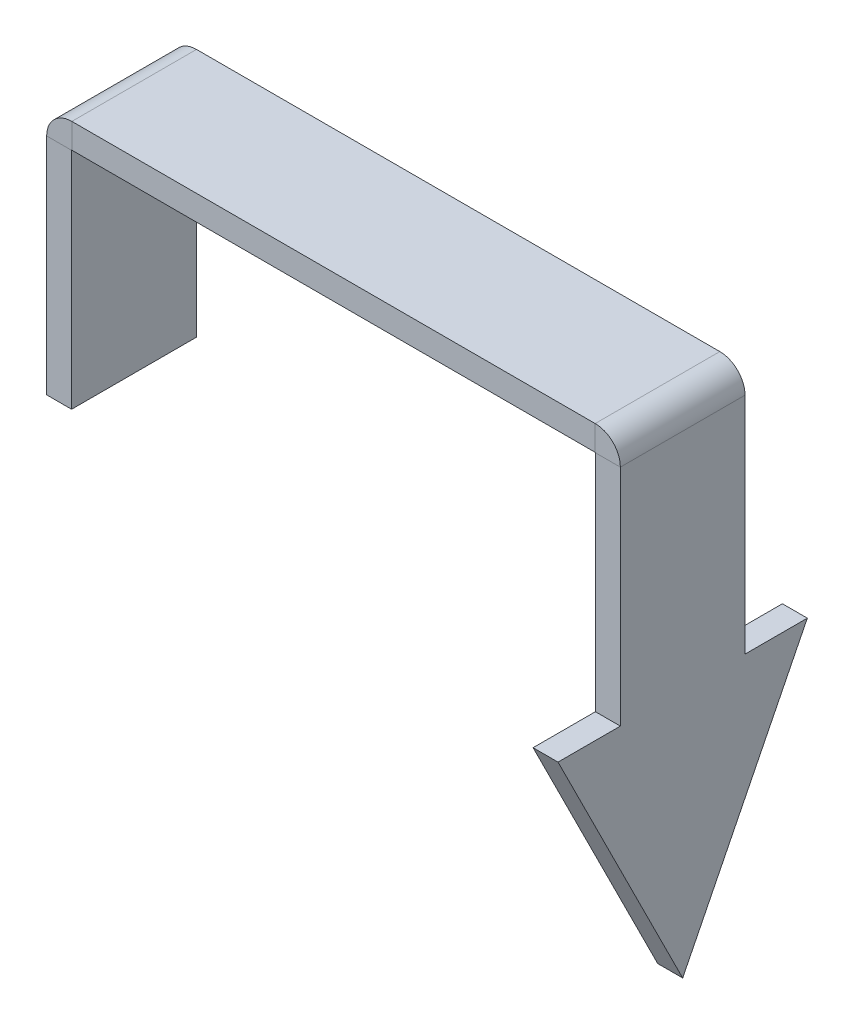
ISO-10303-21;
HEADER;
FILE_DESCRIPTION(('STEP AP214'),'2;1');
FILE_NAME('part.step','',(''),(''),'','','');
FILE_SCHEMA(('AUTOMOTIVE_DESIGN { 1 0 10303 214 1 1 1 1 }'));
ENDSEC;
DATA;
#1=APPLICATION_CONTEXT('core data for automotive mechanical design processes');
#2=APPLICATION_PROTOCOL_DEFINITION('international standard','automotive_design',2000,#1);
#3=PRODUCT_CONTEXT('',#1,'mechanical');
#4=PRODUCT('Part','Part','',(#3));
#5=PRODUCT_RELATED_PRODUCT_CATEGORY('part','',(#4));
#6=PRODUCT_DEFINITION_FORMATION('','',#4);
#7=PRODUCT_DEFINITION_CONTEXT('part definition',#1,'design');
#8=PRODUCT_DEFINITION('design','',#6,#7);
#9=PRODUCT_DEFINITION_SHAPE('','',#8);
#10=(LENGTH_UNIT() NAMED_UNIT(*) SI_UNIT(.MILLI.,.METRE.));
#11=(NAMED_UNIT(*) PLANE_ANGLE_UNIT() SI_UNIT($,.RADIAN.));
#12=(NAMED_UNIT(*) SI_UNIT($,.STERADIAN.) SOLID_ANGLE_UNIT());
#13=UNCERTAINTY_MEASURE_WITH_UNIT(LENGTH_MEASURE(1.E-05),#10,'distance_accuracy_value','');
#14=(GEOMETRIC_REPRESENTATION_CONTEXT(3) GLOBAL_UNCERTAINTY_ASSIGNED_CONTEXT((#13)) GLOBAL_UNIT_ASSIGNED_CONTEXT((#10,
#11,#12)) REPRESENTATION_CONTEXT('',''));
#15=CARTESIAN_POINT('',(0.,0.,0.));
#16=DIRECTION('',(0.,0.,1.));
#17=DIRECTION('',(1.,0.,0.));
#18=AXIS2_PLACEMENT_3D('',#15,#16,#17);
#19=CARTESIAN_POINT('',(33.,0.,-2.5));
#20=DIRECTION('',(0.,1.,0.));
#21=DIRECTION('',(0.,0.,1.));
#22=AXIS2_PLACEMENT_3D('',#19,#20,#21);
#23=PLANE('',#22);
#24=DIRECTION('',(-1.,0.,0.));
#25=VECTOR('',#24,1.);
#26=CARTESIAN_POINT('',(-10.,0.,-2.5));
#27=LINE('',#26,#25);
#28=CARTESIAN_POINT('',(21.995,0.,-2.5));
#29=VERTEX_POINT('',#28);
#30=CARTESIAN_POINT('',(1.00500000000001,0.,-2.5));
#31=VERTEX_POINT('',#30);
#32=EDGE_CURVE('E266',#29,#31,#27,.T.);
#33=ORIENTED_EDGE('',*,*,#32,.F.);
#34=DIRECTION('',(0.,0.,1.));
#35=VECTOR('',#34,1.);
#36=CARTESIAN_POINT('',(21.995,0.,-2.5));
#37=LINE('',#36,#35);
#38=CARTESIAN_POINT('',(21.995,1.53963469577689E-08,2.5));
#39=VERTEX_POINT('',#38);
#40=EDGE_CURVE('E49',#29,#39,#37,.T.);
#41=ORIENTED_EDGE('',*,*,#40,.T.);
#42=DIRECTION('',(1.,0.,0.));
#43=VECTOR('',#42,1.);
#44=CARTESIAN_POINT('',(-10.,0.,2.5));
#45=LINE('',#44,#43);
#46=CARTESIAN_POINT('',(1.00500000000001,0.,2.5));
#47=VERTEX_POINT('',#46);
#48=EDGE_CURVE('E65',#47,#39,#45,.T.);
#49=ORIENTED_EDGE('',*,*,#48,.F.);
#50=DIRECTION('',(0.,0.,1.));
#51=VECTOR('',#50,1.);
#52=CARTESIAN_POINT('',(1.00500000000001,0.,-2.5));
#53=LINE('',#52,#51);
#54=EDGE_CURVE('E274',#31,#47,#53,.T.);
#55=ORIENTED_EDGE('',*,*,#54,.F.);
#56=EDGE_LOOP('',(#33,#41,#49,#55));
#57=FACE_BOUND('',#56,.T.);
#58=ADVANCED_FACE('F40',(#57),#23,.F.);
#59=CARTESIAN_POINT('',(-10.,1.,2.5));
#60=DIRECTION('',(0.,0.,-1.));
#61=DIRECTION('',(-1.,0.,0.));
#62=AXIS2_PLACEMENT_3D('',#59,#60,#61);
#63=PLANE('',#62);
#64=ORIENTED_EDGE('',*,*,#48,.T.);
#65=DIRECTION('',(0.,1.,0.));
#66=VECTOR('',#65,1.);
#67=CARTESIAN_POINT('',(21.995,1.,2.5));
#68=LINE('',#67,#66);
#69=CARTESIAN_POINT('',(21.995,1.00000001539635,2.5));
#70=VERTEX_POINT('',#69);
#71=EDGE_CURVE('E282',#39,#70,#68,.T.);
#72=ORIENTED_EDGE('',*,*,#71,.T.);
#73=DIRECTION('',(1.,0.,0.));
#74=VECTOR('',#73,1.);
#75=CARTESIAN_POINT('',(-10.,1.,2.5));
#76=LINE('',#75,#74);
#77=CARTESIAN_POINT('',(1.005,0.999999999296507,2.5));
#78=VERTEX_POINT('',#77);
#79=EDGE_CURVE('E271',#78,#70,#76,.T.);
#80=ORIENTED_EDGE('',*,*,#79,.F.);
#81=DIRECTION('',(0.,1.,0.));
#82=VECTOR('',#81,1.);
#83=CARTESIAN_POINT('',(1.005,1.,2.5));
#84=LINE('',#83,#82);
#85=EDGE_CURVE('E277',#47,#78,#84,.T.);
#86=ORIENTED_EDGE('',*,*,#85,.F.);
#87=EDGE_LOOP('',(#64,#72,#80,#86));
#88=FACE_BOUND('',#87,.T.);
#89=ADVANCED_FACE('F338',(#88),#63,.F.);
#90=CARTESIAN_POINT('',(-10.,1.,-2.5));
#91=DIRECTION('',(0.,0.,1.));
#92=DIRECTION('',(1.,0.,0.));
#93=AXIS2_PLACEMENT_3D('',#90,#91,#92);
#94=PLANE('',#93);
#95=DIRECTION('',(-1.,0.,0.));
#96=VECTOR('',#95,1.);
#97=CARTESIAN_POINT('',(-10.,1.,-2.5));
#98=LINE('',#97,#96);
#99=CARTESIAN_POINT('',(21.995,1.00000000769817,-2.5));
#100=VERTEX_POINT('',#99);
#101=CARTESIAN_POINT('',(1.005,1.,-2.5));
#102=VERTEX_POINT('',#101);
#103=EDGE_CURVE('E44',#100,#102,#98,.T.);
#104=ORIENTED_EDGE('',*,*,#103,.F.);
#105=DIRECTION('',(0.,-1.,0.));
#106=VECTOR('',#105,1.);
#107=CARTESIAN_POINT('',(21.995,1.,-2.5));
#108=LINE('',#107,#106);
#109=EDGE_CURVE('E12',#100,#29,#108,.T.);
#110=ORIENTED_EDGE('',*,*,#109,.T.);
#111=ORIENTED_EDGE('',*,*,#32,.T.);
#112=DIRECTION('',(0.,-1.,0.));
#113=VECTOR('',#112,1.);
#114=CARTESIAN_POINT('',(1.005,1.,-2.5));
#115=LINE('',#114,#113);
#116=EDGE_CURVE('E270',#102,#31,#115,.T.);
#117=ORIENTED_EDGE('',*,*,#116,.F.);
#118=EDGE_LOOP('',(#104,#110,#111,#117));
#119=FACE_BOUND('',#118,.T.);
#120=ADVANCED_FACE('F42',(#119),#94,.F.);
#121=CARTESIAN_POINT('',(33.,1.,-2.5));
#122=DIRECTION('',(0.,1.,0.));
#123=DIRECTION('',(0.,0.,1.));
#124=AXIS2_PLACEMENT_3D('',#121,#122,#123);
#125=PLANE('',#124);
#126=DIRECTION('',(0.,0.,1.));
#127=VECTOR('',#126,1.);
#128=CARTESIAN_POINT('',(21.995,1.,-2.5));
#129=LINE('',#128,#127);
#130=EDGE_CURVE('E280',#100,#70,#129,.T.);
#131=ORIENTED_EDGE('',*,*,#130,.F.);
#132=ORIENTED_EDGE('',*,*,#103,.T.);
#133=DIRECTION('',(0.,0.,1.));
#134=VECTOR('',#133,1.);
#135=CARTESIAN_POINT('',(1.00500000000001,1.,-2.5));
#136=LINE('',#135,#134);
#137=EDGE_CURVE('E267',#102,#78,#136,.T.);
#138=ORIENTED_EDGE('',*,*,#137,.T.);
#139=ORIENTED_EDGE('',*,*,#79,.T.);
#140=EDGE_LOOP('',(#131,#132,#138,#139));
#141=FACE_BOUND('',#140,.T.);
#142=ADVANCED_FACE('F292',(#141),#125,.T.);
#143=CARTESIAN_POINT('',(1.00500000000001,-0.00999999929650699,-2.5));
#144=DIRECTION('',(0.,0.,-1.));
#145=DIRECTION('',(-1.,0.,0.));
#146=AXIS2_PLACEMENT_3D('',#143,#144,#145);
#147=PLANE('',#146);
#148=ORIENTED_EDGE('',*,*,#116,.T.);
#149=CARTESIAN_POINT('',(1.00500000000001,-0.01,-2.5));
#150=DIRECTION('',(0.,0.,1.));
#151=DIRECTION('',(1.,0.,0.));
#152=AXIS2_PLACEMENT_3D('',#149,#150,#151);
#153=CIRCLE('',#152,0.00999999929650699);
#154=CARTESIAN_POINT('',(0.995000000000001,-0.0100000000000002,-2.5));
#155=VERTEX_POINT('',#154);
#156=EDGE_CURVE('E228',#31,#155,#153,.T.);
#157=ORIENTED_EDGE('',*,*,#156,.T.);
#158=DIRECTION('',(1.,0.,0.));
#159=VECTOR('',#158,1.);
#160=CARTESIAN_POINT('',(-0.00499999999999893,-0.010000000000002,-2.5));
#161=LINE('',#160,#159);
#162=CARTESIAN_POINT('',(-0.00499999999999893,-0.0100000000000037,-2.5));
#163=VERTEX_POINT('',#162);
#164=EDGE_CURVE('E238',#163,#155,#161,.T.);
#165=ORIENTED_EDGE('',*,*,#164,.F.);
#166=CARTESIAN_POINT('',(1.00500000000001,-0.00999999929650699,-2.5));
#167=DIRECTION('',(0.,0.,1.));
#168=DIRECTION('',(1.,0.,0.));
#169=AXIS2_PLACEMENT_3D('',#166,#167,#168);
#170=CIRCLE('',#169,1.00999999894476);
#171=EDGE_CURVE('E260',#102,#163,#170,.T.);
#172=ORIENTED_EDGE('',*,*,#171,.F.);
#173=EDGE_LOOP('',(#148,#157,#165,#172));
#174=FACE_BOUND('',#173,.T.);
#175=ADVANCED_FACE('F303',(#174),#147,.T.);
#176=CARTESIAN_POINT('',(1.00500000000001,-0.00999999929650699,2.5));
#177=DIRECTION('',(0.,0.,1.));
#178=DIRECTION('',(1.,0.,0.));
#179=AXIS2_PLACEMENT_3D('',#176,#177,#178);
#180=PLANE('',#179);
#181=CARTESIAN_POINT('',(1.00500000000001,-0.01,2.5));
#182=DIRECTION('',(0.,0.,1.));
#183=DIRECTION('',(1.,0.,0.));
#184=AXIS2_PLACEMENT_3D('',#181,#182,#183);
#185=CIRCLE('',#184,0.00999999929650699);
#186=CARTESIAN_POINT('',(0.995000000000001,-0.0100000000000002,2.5));
#187=VERTEX_POINT('',#186);
#188=EDGE_CURVE('E257',#187,#47,#185,.F.);
#189=ORIENTED_EDGE('',*,*,#188,.T.);
#190=ORIENTED_EDGE('',*,*,#85,.T.);
#191=CARTESIAN_POINT('',(1.00500000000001,-0.00999999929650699,2.5));
#192=DIRECTION('',(0.,0.,-1.));
#193=DIRECTION('',(-1.,0.,0.));
#194=AXIS2_PLACEMENT_3D('',#191,#192,#193);
#195=CIRCLE('',#194,1.00999999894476);
#196=CARTESIAN_POINT('',(-0.00499999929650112,-0.0100000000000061,2.5));
#197=VERTEX_POINT('',#196);
#198=EDGE_CURVE('E263',#197,#78,#195,.T.);
#199=ORIENTED_EDGE('',*,*,#198,.F.);
#200=DIRECTION('',(-1.,0.,0.));
#201=VECTOR('',#200,1.);
#202=CARTESIAN_POINT('',(-0.00499999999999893,-0.010000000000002,2.5));
#203=LINE('',#202,#201);
#204=EDGE_CURVE('E229',#187,#197,#203,.T.);
#205=ORIENTED_EDGE('',*,*,#204,.F.);
#206=EDGE_LOOP('',(#189,#190,#199,#205));
#207=FACE_BOUND('',#206,.T.);
#208=ADVANCED_FACE('F318',(#207),#180,.T.);
#209=CARTESIAN_POINT('',(1.00500000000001,-0.01,-5.48088496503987));
#210=DIRECTION('',(0.,0.,1.));
#211=DIRECTION('',(1.,0.,0.));
#212=AXIS2_PLACEMENT_3D('',#209,#210,#211);
#213=CYLINDRICAL_SURFACE('',#212,1.00999999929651);
#214=DIRECTION('',(0.,0.,1.));
#215=VECTOR('',#214,1.);
#216=CARTESIAN_POINT('',(-0.00499999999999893,-0.0100000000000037,-2.5));
#217=LINE('',#216,#215);
#218=EDGE_CURVE('E224',#163,#197,#217,.T.);
#219=ORIENTED_EDGE('',*,*,#218,.T.);
#220=ORIENTED_EDGE('',*,*,#198,.T.);
#221=ORIENTED_EDGE('',*,*,#137,.F.);
#222=ORIENTED_EDGE('',*,*,#171,.T.);
#223=EDGE_LOOP('',(#219,#220,#221,#222));
#224=FACE_BOUND('',#223,.T.);
#225=ADVANCED_FACE('F300',(#224),#213,.T.);
#226=CARTESIAN_POINT('',(1.00500000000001,-0.01,-5.48088496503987));
#227=DIRECTION('',(0.,0.,1.));
#228=DIRECTION('',(1.,0.,0.));
#229=AXIS2_PLACEMENT_3D('',#226,#227,#228);
#230=CYLINDRICAL_SURFACE('',#229,0.00999999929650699);
#231=DIRECTION('',(0.,0.,1.));
#232=VECTOR('',#231,1.);
#233=CARTESIAN_POINT('',(0.995000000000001,-0.0100000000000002,-2.5));
#234=LINE('',#233,#232);
#235=EDGE_CURVE('E233',#155,#187,#234,.T.);
#236=ORIENTED_EDGE('',*,*,#235,.F.);
#237=ORIENTED_EDGE('',*,*,#156,.F.);
#238=ORIENTED_EDGE('',*,*,#54,.T.);
#239=ORIENTED_EDGE('',*,*,#188,.F.);
#240=EDGE_LOOP('',(#236,#237,#238,#239));
#241=FACE_BOUND('',#240,.T.);
#242=ADVANCED_FACE('F311',(#241),#230,.F.);
#243=CARTESIAN_POINT('',(-0.00499999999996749,-9.005,-2.5));
#244=DIRECTION('',(0.,1.,0.));
#245=DIRECTION('',(0.,0.,-1.));
#246=AXIS2_PLACEMENT_3D('',#243,#244,#245);
#247=PLANE('',#246);
#248=DIRECTION('',(0.,0.,1.));
#249=VECTOR('',#248,1.);
#250=CARTESIAN_POINT('',(0.995000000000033,-9.00499999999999,-2.5));
#251=LINE('',#250,#249);
#252=CARTESIAN_POINT('',(0.995000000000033,-9.00499999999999,-2.5));
#253=VERTEX_POINT('',#252);
#254=CARTESIAN_POINT('',(0.995000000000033,-9.00499999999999,2.5));
#255=VERTEX_POINT('',#254);
#256=EDGE_CURVE('E251',#253,#255,#251,.T.);
#257=ORIENTED_EDGE('',*,*,#256,.T.);
#258=DIRECTION('',(1.,0.,0.));
#259=VECTOR('',#258,1.);
#260=CARTESIAN_POINT('',(-0.00499999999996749,-9.005,2.5));
#261=LINE('',#260,#259);
#262=CARTESIAN_POINT('',(-0.00499999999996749,-9.005,2.5));
#263=VERTEX_POINT('',#262);
#264=EDGE_CURVE('E225',#263,#255,#261,.T.);
#265=ORIENTED_EDGE('',*,*,#264,.F.);
#266=DIRECTION('',(0.,0.,1.));
#267=VECTOR('',#266,1.);
#268=CARTESIAN_POINT('',(-0.00499999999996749,-9.005,-2.5));
#269=LINE('',#268,#267);
#270=CARTESIAN_POINT('',(-0.00499999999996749,-9.005,-2.5));
#271=VERTEX_POINT('',#270);
#272=EDGE_CURVE('E244',#271,#263,#269,.T.);
#273=ORIENTED_EDGE('',*,*,#272,.F.);
#274=DIRECTION('',(1.,0.,0.));
#275=VECTOR('',#274,1.);
#276=CARTESIAN_POINT('',(-0.00499999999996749,-9.005,-2.5));
#277=LINE('',#276,#275);
#278=EDGE_CURVE('E248',#271,#253,#277,.T.);
#279=ORIENTED_EDGE('',*,*,#278,.T.);
#280=EDGE_LOOP('',(#257,#265,#273,#279));
#281=FACE_BOUND('',#280,.T.);
#282=ADVANCED_FACE('F327',(#281),#247,.F.);
#283=CARTESIAN_POINT('',(-0.00500000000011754,33.995,-2.5));
#284=DIRECTION('',(-1.,0.,0.));
#285=DIRECTION('',(0.,0.,1.));
#286=AXIS2_PLACEMENT_3D('',#283,#284,#285);
#287=PLANE('',#286);
#288=ORIENTED_EDGE('',*,*,#218,.F.);
#289=DIRECTION('',(0.,-1.,0.));
#290=VECTOR('',#289,1.);
#291=CARTESIAN_POINT('',(-0.00499999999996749,-9.005,-2.5));
#292=LINE('',#291,#290);
#293=EDGE_CURVE('E246',#163,#271,#292,.T.);
#294=ORIENTED_EDGE('',*,*,#293,.T.);
#295=ORIENTED_EDGE('',*,*,#272,.T.);
#296=DIRECTION('',(0.,1.,0.));
#297=VECTOR('',#296,1.);
#298=CARTESIAN_POINT('',(-0.00499999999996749,-9.005,2.5));
#299=LINE('',#298,#297);
#300=EDGE_CURVE('E241',#263,#197,#299,.T.);
#301=ORIENTED_EDGE('',*,*,#300,.T.);
#302=EDGE_LOOP('',(#288,#294,#295,#301));
#303=FACE_BOUND('',#302,.T.);
#304=ADVANCED_FACE('F323',(#303),#287,.T.);
#305=CARTESIAN_POINT('',(-0.00499999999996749,-9.005,-2.5));
#306=DIRECTION('',(0.,0.,1.));
#307=DIRECTION('',(0.,1.,0.));
#308=AXIS2_PLACEMENT_3D('',#305,#306,#307);
#309=PLANE('',#308);
#310=ORIENTED_EDGE('',*,*,#293,.F.);
#311=ORIENTED_EDGE('',*,*,#164,.T.);
#312=DIRECTION('',(0.,-1.,0.));
#313=VECTOR('',#312,1.);
#314=CARTESIAN_POINT('',(0.995000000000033,-9.00499999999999,-2.5));
#315=LINE('',#314,#313);
#316=EDGE_CURVE('E236',#155,#253,#315,.T.);
#317=ORIENTED_EDGE('',*,*,#316,.T.);
#318=ORIENTED_EDGE('',*,*,#278,.F.);
#319=EDGE_LOOP('',(#310,#311,#317,#318));
#320=FACE_BOUND('',#319,.T.);
#321=ADVANCED_FACE('F307',(#320),#309,.F.);
#322=CARTESIAN_POINT('',(0.994999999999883,33.995,-2.5));
#323=DIRECTION('',(-1.,0.,0.));
#324=DIRECTION('',(0.,0.,1.));
#325=AXIS2_PLACEMENT_3D('',#322,#323,#324);
#326=PLANE('',#325);
#327=ORIENTED_EDGE('',*,*,#316,.F.);
#328=ORIENTED_EDGE('',*,*,#235,.T.);
#329=DIRECTION('',(0.,1.,0.));
#330=VECTOR('',#329,1.);
#331=CARTESIAN_POINT('',(0.995000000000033,-9.00499999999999,2.5));
#332=LINE('',#331,#330);
#333=EDGE_CURVE('E231',#255,#187,#332,.T.);
#334=ORIENTED_EDGE('',*,*,#333,.F.);
#335=ORIENTED_EDGE('',*,*,#256,.F.);
#336=EDGE_LOOP('',(#327,#328,#334,#335));
#337=FACE_BOUND('',#336,.T.);
#338=ADVANCED_FACE('F315',(#337),#326,.F.);
#339=CARTESIAN_POINT('',(-0.00499999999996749,-9.005,2.5));
#340=DIRECTION('',(0.,0.,-1.));
#341=DIRECTION('',(0.,-1.,0.));
#342=AXIS2_PLACEMENT_3D('',#339,#340,#341);
#343=PLANE('',#342);
#344=ORIENTED_EDGE('',*,*,#333,.T.);
#345=ORIENTED_EDGE('',*,*,#204,.T.);
#346=ORIENTED_EDGE('',*,*,#300,.F.);
#347=ORIENTED_EDGE('',*,*,#264,.T.);
#348=EDGE_LOOP('',(#344,#345,#346,#347));
#349=FACE_BOUND('',#348,.T.);
#350=ADVANCED_FACE('F321',(#349),#343,.F.);
#351=CARTESIAN_POINT('',(21.995,-0.010000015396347,-2.5));
#352=DIRECTION('',(0.,0.,-1.));
#353=DIRECTION('',(-1.,0.,0.));
#354=AXIS2_PLACEMENT_3D('',#351,#352,#353);
#355=PLANE('',#354);
#356=DIRECTION('',(-1.,0.,0.));
#357=VECTOR('',#356,1.);
#358=CARTESIAN_POINT('',(23.005,-0.0100000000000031,-2.5));
#359=LINE('',#358,#357);
#360=CARTESIAN_POINT('',(23.0050000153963,-0.010000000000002,-2.5));
#361=VERTEX_POINT('',#360);
#362=CARTESIAN_POINT('',(22.005,-0.00999999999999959,-2.5));
#363=VERTEX_POINT('',#362);
#364=EDGE_CURVE('E158',#361,#363,#359,.T.);
#365=ORIENTED_EDGE('',*,*,#364,.T.);
#366=CARTESIAN_POINT('',(21.995,-0.01,-2.5));
#367=DIRECTION('',(0.,0.,-1.));
#368=DIRECTION('',(-1.,0.,0.));
#369=AXIS2_PLACEMENT_3D('',#366,#367,#368);
#370=CIRCLE('',#369,0.010000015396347);
#371=EDGE_CURVE('E57',#363,#29,#370,.F.);
#372=ORIENTED_EDGE('',*,*,#371,.T.);
#373=ORIENTED_EDGE('',*,*,#109,.F.);
#374=CARTESIAN_POINT('',(21.995,-0.010000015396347,-2.5));
#375=DIRECTION('',(0.,0.,1.));
#376=DIRECTION('',(1.,0.,0.));
#377=AXIS2_PLACEMENT_3D('',#374,#375,#376);
#378=CIRCLE('',#377,1.01000002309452);
#379=EDGE_CURVE('E218',#361,#100,#378,.T.);
#380=ORIENTED_EDGE('',*,*,#379,.F.);
#381=EDGE_LOOP('',(#365,#372,#373,#380));
#382=FACE_BOUND('',#381,.T.);
#383=ADVANCED_FACE('F355',(#382),#355,.T.);
#384=CARTESIAN_POINT('',(21.995,-0.010000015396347,2.5));
#385=DIRECTION('',(0.,0.,1.));
#386=DIRECTION('',(1.,0.,0.));
#387=AXIS2_PLACEMENT_3D('',#384,#385,#386);
#388=PLANE('',#387);
#389=CARTESIAN_POINT('',(21.995,-0.01,2.5));
#390=DIRECTION('',(0.,0.,-1.));
#391=DIRECTION('',(-1.,0.,0.));
#392=AXIS2_PLACEMENT_3D('',#389,#390,#391);
#393=CIRCLE('',#392,0.010000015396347);
#394=CARTESIAN_POINT('',(22.005,-0.00999999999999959,2.5));
#395=VERTEX_POINT('',#394);
#396=EDGE_CURVE('E215',#39,#395,#393,.T.);
#397=ORIENTED_EDGE('',*,*,#396,.T.);
#398=DIRECTION('',(1.,0.,0.));
#399=VECTOR('',#398,1.);
#400=CARTESIAN_POINT('',(23.005,-0.0100000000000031,2.5));
#401=LINE('',#400,#399);
#402=CARTESIAN_POINT('',(23.005,-0.0100000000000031,2.5));
#403=VERTEX_POINT('',#402);
#404=EDGE_CURVE('E207',#395,#403,#401,.T.);
#405=ORIENTED_EDGE('',*,*,#404,.T.);
#406=CARTESIAN_POINT('',(21.995,-0.010000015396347,2.5));
#407=DIRECTION('',(0.,0.,-1.));
#408=DIRECTION('',(-1.,0.,0.));
#409=AXIS2_PLACEMENT_3D('',#406,#407,#408);
#410=CIRCLE('',#409,1.01000002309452);
#411=EDGE_CURVE('E221',#70,#403,#410,.T.);
#412=ORIENTED_EDGE('',*,*,#411,.F.);
#413=ORIENTED_EDGE('',*,*,#71,.F.);
#414=EDGE_LOOP('',(#397,#405,#412,#413));
#415=FACE_BOUND('',#414,.T.);
#416=ADVANCED_FACE('F377',(#415),#388,.T.);
#417=CARTESIAN_POINT('',(21.995,-0.01,5.48088496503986));
#418=DIRECTION('',(0.,0.,-1.));
#419=DIRECTION('',(-1.,0.,0.));
#420=AXIS2_PLACEMENT_3D('',#417,#418,#419);
#421=CYLINDRICAL_SURFACE('',#420,1.01000001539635);
#422=ORIENTED_EDGE('',*,*,#130,.T.);
#423=ORIENTED_EDGE('',*,*,#411,.T.);
#424=DIRECTION('',(0.,0.,1.));
#425=VECTOR('',#424,1.);
#426=CARTESIAN_POINT('',(23.005,-0.0100000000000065,-2.5));
#427=LINE('',#426,#425);
#428=EDGE_CURVE('E161',#361,#403,#427,.T.);
#429=ORIENTED_EDGE('',*,*,#428,.F.);
#430=ORIENTED_EDGE('',*,*,#379,.T.);
#431=EDGE_LOOP('',(#422,#423,#429,#430));
#432=FACE_BOUND('',#431,.T.);
#433=ADVANCED_FACE('F379',(#432),#421,.T.);
#434=CARTESIAN_POINT('',(21.995,-0.01,5.48088496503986));
#435=DIRECTION('',(0.,0.,-1.));
#436=DIRECTION('',(-1.,0.,0.));
#437=AXIS2_PLACEMENT_3D('',#434,#435,#436);
#438=CYLINDRICAL_SURFACE('',#437,0.010000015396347);
#439=ORIENTED_EDGE('',*,*,#40,.F.);
#440=ORIENTED_EDGE('',*,*,#371,.F.);
#441=DIRECTION('',(0.,0.,1.));
#442=VECTOR('',#441,1.);
#443=CARTESIAN_POINT('',(22.005,-0.0100000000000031,-2.5));
#444=LINE('',#443,#442);
#445=EDGE_CURVE('E210',#363,#395,#444,.T.);
#446=ORIENTED_EDGE('',*,*,#445,.T.);
#447=ORIENTED_EDGE('',*,*,#396,.F.);
#448=EDGE_LOOP('',(#439,#440,#446,#447));
#449=FACE_BOUND('',#448,.T.);
#450=ADVANCED_FACE('F386',(#449),#438,.F.);
#451=CARTESIAN_POINT('',(23.005,-9.00500000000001,-5.));
#452=DIRECTION('',(0.,-1.,0.));
#453=DIRECTION('',(0.,0.,-1.));
#454=AXIS2_PLACEMENT_3D('',#451,#452,#453);
#455=PLANE('',#454);
#456=DIRECTION('',(0.,0.,1.));
#457=VECTOR('',#456,1.);
#458=CARTESIAN_POINT('',(22.005,-9.005,-5.));
#459=LINE('',#458,#457);
#460=CARTESIAN_POINT('',(22.005,-9.005,-5.));
#461=VERTEX_POINT('',#460);
#462=CARTESIAN_POINT('',(22.005,-9.005,-2.5));
#463=VERTEX_POINT('',#462);
#464=EDGE_CURVE('E176',#461,#463,#459,.T.);
#465=ORIENTED_EDGE('',*,*,#464,.T.);
#466=DIRECTION('',(-1.,0.,0.));
#467=VECTOR('',#466,1.);
#468=CARTESIAN_POINT('',(23.005,-9.00500000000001,-2.5));
#469=LINE('',#468,#467);
#470=CARTESIAN_POINT('',(23.005,-9.00500000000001,-2.5));
#471=VERTEX_POINT('',#470);
#472=EDGE_CURVE('E156',#471,#463,#469,.T.);
#473=ORIENTED_EDGE('',*,*,#472,.F.);
#474=DIRECTION('',(0.,0.,1.));
#475=VECTOR('',#474,1.);
#476=CARTESIAN_POINT('',(23.005,-9.00500000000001,-5.));
#477=LINE('',#476,#475);
#478=CARTESIAN_POINT('',(23.005,-9.00500000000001,-5.));
#479=VERTEX_POINT('',#478);
#480=EDGE_CURVE('E165',#479,#471,#477,.T.);
#481=ORIENTED_EDGE('',*,*,#480,.F.);
#482=DIRECTION('',(-1.,0.,0.));
#483=VECTOR('',#482,1.);
#484=CARTESIAN_POINT('',(23.005,-9.00500000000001,-5.));
#485=LINE('',#484,#483);
#486=EDGE_CURVE('E204',#479,#461,#485,.T.);
#487=ORIENTED_EDGE('',*,*,#486,.T.);
#488=EDGE_LOOP('',(#465,#473,#481,#487));
#489=FACE_BOUND('',#488,.T.);
#490=ADVANCED_FACE('F174',(#489),#455,.F.);
#491=CARTESIAN_POINT('',(23.0049999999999,-19.005,0.));
#492=DIRECTION('',(0.,0.447213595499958,0.894427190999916));
#493=DIRECTION('',(0.,-0.894427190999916,0.447213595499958));
#494=AXIS2_PLACEMENT_3D('',#491,#492,#493);
#495=PLANE('',#494);
#496=DIRECTION('',(0.,0.894427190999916,-0.447213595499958));
#497=VECTOR('',#496,1.);
#498=CARTESIAN_POINT('',(22.0049999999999,-19.005,0.));
#499=LINE('',#498,#497);
#500=CARTESIAN_POINT('',(22.0049999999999,-19.005,0.));
#501=VERTEX_POINT('',#500);
#502=EDGE_CURVE('E202',#501,#461,#499,.T.);
#503=ORIENTED_EDGE('',*,*,#502,.T.);
#504=ORIENTED_EDGE('',*,*,#486,.F.);
#505=DIRECTION('',(0.,0.894427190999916,-0.447213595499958));
#506=VECTOR('',#505,1.);
#507=CARTESIAN_POINT('',(23.0049999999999,-19.005,0.));
#508=LINE('',#507,#506);
#509=CARTESIAN_POINT('',(23.0049999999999,-19.005,0.));
#510=VERTEX_POINT('',#509);
#511=EDGE_CURVE('E168',#510,#479,#508,.T.);
#512=ORIENTED_EDGE('',*,*,#511,.F.);
#513=DIRECTION('',(-1.,0.,0.));
#514=VECTOR('',#513,1.);
#515=CARTESIAN_POINT('',(23.0049999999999,-19.005,0.));
#516=LINE('',#515,#514);
#517=EDGE_CURVE('E199',#510,#501,#516,.T.);
#518=ORIENTED_EDGE('',*,*,#517,.T.);
#519=EDGE_LOOP('',(#503,#504,#512,#518));
#520=FACE_BOUND('',#519,.T.);
#521=ADVANCED_FACE('F406',(#520),#495,.F.);
#522=CARTESIAN_POINT('',(23.005,-9.00500000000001,5.));
#523=DIRECTION('',(0.,0.447213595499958,-0.894427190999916));
#524=DIRECTION('',(0.,0.894427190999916,0.447213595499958));
#525=AXIS2_PLACEMENT_3D('',#522,#523,#524);
#526=PLANE('',#525);
#527=DIRECTION('',(0.,-0.894427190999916,-0.447213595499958));
#528=VECTOR('',#527,1.);
#529=CARTESIAN_POINT('',(22.005,-9.005,5.));
#530=LINE('',#529,#528);
#531=CARTESIAN_POINT('',(22.005,-9.005,5.));
#532=VERTEX_POINT('',#531);
#533=EDGE_CURVE('E197',#532,#501,#530,.T.);
#534=ORIENTED_EDGE('',*,*,#533,.T.);
#535=ORIENTED_EDGE('',*,*,#517,.F.);
#536=DIRECTION('',(0.,-0.894427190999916,-0.447213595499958));
#537=VECTOR('',#536,1.);
#538=CARTESIAN_POINT('',(23.005,-9.00500000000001,5.));
#539=LINE('',#538,#537);
#540=CARTESIAN_POINT('',(23.005,-9.00500000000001,5.));
#541=VERTEX_POINT('',#540);
#542=EDGE_CURVE('E183',#541,#510,#539,.T.);
#543=ORIENTED_EDGE('',*,*,#542,.F.);
#544=DIRECTION('',(-1.,0.,0.));
#545=VECTOR('',#544,1.);
#546=CARTESIAN_POINT('',(23.005,-9.00500000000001,5.));
#547=LINE('',#546,#545);
#548=EDGE_CURVE('E194',#541,#532,#547,.T.);
#549=ORIENTED_EDGE('',*,*,#548,.T.);
#550=EDGE_LOOP('',(#534,#535,#543,#549));
#551=FACE_BOUND('',#550,.T.);
#552=ADVANCED_FACE('F413',(#551),#526,.F.);
#553=CARTESIAN_POINT('',(23.005,-9.00500000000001,2.5));
#554=DIRECTION('',(0.,-1.,0.));
#555=DIRECTION('',(0.,0.,-1.));
#556=AXIS2_PLACEMENT_3D('',#553,#554,#555);
#557=PLANE('',#556);
#558=DIRECTION('',(0.,0.,1.));
#559=VECTOR('',#558,1.);
#560=CARTESIAN_POINT('',(22.005,-9.005,2.5));
#561=LINE('',#560,#559);
#562=CARTESIAN_POINT('',(22.005,-9.005,2.5));
#563=VERTEX_POINT('',#562);
#564=EDGE_CURVE('E192',#563,#532,#561,.T.);
#565=ORIENTED_EDGE('',*,*,#564,.T.);
#566=ORIENTED_EDGE('',*,*,#548,.F.);
#567=DIRECTION('',(0.,0.,1.));
#568=VECTOR('',#567,1.);
#569=CARTESIAN_POINT('',(23.005,-9.00500000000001,2.5));
#570=LINE('',#569,#568);
#571=CARTESIAN_POINT('',(23.005,-9.00500000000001,2.5));
#572=VERTEX_POINT('',#571);
#573=EDGE_CURVE('E185',#572,#541,#570,.T.);
#574=ORIENTED_EDGE('',*,*,#573,.F.);
#575=DIRECTION('',(-1.,0.,0.));
#576=VECTOR('',#575,1.);
#577=CARTESIAN_POINT('',(23.005,-9.00500000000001,2.5));
#578=LINE('',#577,#576);
#579=EDGE_CURVE('E162',#572,#563,#578,.T.);
#580=ORIENTED_EDGE('',*,*,#579,.T.);
#581=EDGE_LOOP('',(#565,#566,#574,#580));
#582=FACE_BOUND('',#581,.T.);
#583=ADVANCED_FACE('F421',(#582),#557,.F.);
#584=CARTESIAN_POINT('',(23.005,-9.00500000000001,-2.5));
#585=DIRECTION('',(1.,0.,0.));
#586=DIRECTION('',(0.,0.,1.));
#587=AXIS2_PLACEMENT_3D('',#584,#585,#586);
#588=PLANE('',#587);
#589=DIRECTION('',(0.,1.,0.));
#590=VECTOR('',#589,1.);
#591=CARTESIAN_POINT('',(23.0050000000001,33.995,-2.5));
#592=LINE('',#591,#590);
#593=EDGE_CURVE('E152',#471,#361,#592,.T.);
#594=ORIENTED_EDGE('',*,*,#593,.T.);
#595=ORIENTED_EDGE('',*,*,#428,.T.);
#596=DIRECTION('',(0.,-1.,0.));
#597=VECTOR('',#596,1.);
#598=CARTESIAN_POINT('',(23.0050000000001,33.995,2.5));
#599=LINE('',#598,#597);
#600=EDGE_CURVE('E187',#403,#572,#599,.T.);
#601=ORIENTED_EDGE('',*,*,#600,.T.);
#602=ORIENTED_EDGE('',*,*,#573,.T.);
#603=ORIENTED_EDGE('',*,*,#542,.T.);
#604=ORIENTED_EDGE('',*,*,#511,.T.);
#605=ORIENTED_EDGE('',*,*,#480,.T.);
#606=EDGE_LOOP('',(#594,#595,#601,#602,#603,#604,#605));
#607=FACE_BOUND('',#606,.T.);
#608=ADVANCED_FACE('F166',(#607),#588,.T.);
#609=CARTESIAN_POINT('',(23.0050000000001,33.995,2.5));
#610=DIRECTION('',(0.,0.,-1.));
#611=DIRECTION('',(0.,1.,0.));
#612=AXIS2_PLACEMENT_3D('',#609,#610,#611);
#613=PLANE('',#612);
#614=ORIENTED_EDGE('',*,*,#404,.F.);
#615=DIRECTION('',(0.,-1.,0.));
#616=VECTOR('',#615,1.);
#617=CARTESIAN_POINT('',(22.0050000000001,33.995,2.5));
#618=LINE('',#617,#616);
#619=EDGE_CURVE('E172',#395,#563,#618,.T.);
#620=ORIENTED_EDGE('',*,*,#619,.T.);
#621=ORIENTED_EDGE('',*,*,#579,.F.);
#622=ORIENTED_EDGE('',*,*,#600,.F.);
#623=EDGE_LOOP('',(#614,#620,#621,#622));
#624=FACE_BOUND('',#623,.T.);
#625=ADVANCED_FACE('F436',(#624),#613,.F.);
#626=CARTESIAN_POINT('',(22.005,-9.005,-2.5));
#627=DIRECTION('',(1.,0.,0.));
#628=DIRECTION('',(0.,0.,1.));
#629=AXIS2_PLACEMENT_3D('',#626,#627,#628);
#630=PLANE('',#629);
#631=ORIENTED_EDGE('',*,*,#445,.F.);
#632=DIRECTION('',(0.,1.,0.));
#633=VECTOR('',#632,1.);
#634=CARTESIAN_POINT('',(22.0050000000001,33.995,-2.5));
#635=LINE('',#634,#633);
#636=EDGE_CURVE('E177',#463,#363,#635,.T.);
#637=ORIENTED_EDGE('',*,*,#636,.F.);
#638=ORIENTED_EDGE('',*,*,#464,.F.);
#639=ORIENTED_EDGE('',*,*,#502,.F.);
#640=ORIENTED_EDGE('',*,*,#533,.F.);
#641=ORIENTED_EDGE('',*,*,#564,.F.);
#642=ORIENTED_EDGE('',*,*,#619,.F.);
#643=EDGE_LOOP('',(#631,#637,#638,#639,#640,#641,#642));
#644=FACE_BOUND('',#643,.T.);
#645=ADVANCED_FACE('F443',(#644),#630,.F.);
#646=CARTESIAN_POINT('',(23.0050000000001,33.995,-2.5));
#647=DIRECTION('',(0.,0.,1.));
#648=DIRECTION('',(0.,-1.,0.));
#649=AXIS2_PLACEMENT_3D('',#646,#647,#648);
#650=PLANE('',#649);
#651=ORIENTED_EDGE('',*,*,#364,.F.);
#652=ORIENTED_EDGE('',*,*,#593,.F.);
#653=ORIENTED_EDGE('',*,*,#472,.T.);
#654=ORIENTED_EDGE('',*,*,#636,.T.);
#655=EDGE_LOOP('',(#651,#652,#653,#654));
#656=FACE_BOUND('',#655,.T.);
#657=ADVANCED_FACE('F154',(#656),#650,.F.);
#658=CLOSED_SHELL('',(#58,#89,#120,#142,#175,#208,#225,#242,#282,#304,#321,#338,#350,#383,#416,
#433,#450,#490,#521,#552,#583,#608,#625,#645,#657));
#659=MANIFOLD_SOLID_BREP('B2',#658);
#660=ADVANCED_BREP_SHAPE_REPRESENTATION('',(#18,#659),#14);
#661=SHAPE_DEFINITION_REPRESENTATION(#9,#660);
ENDSEC;
END-ISO-10303-21;
